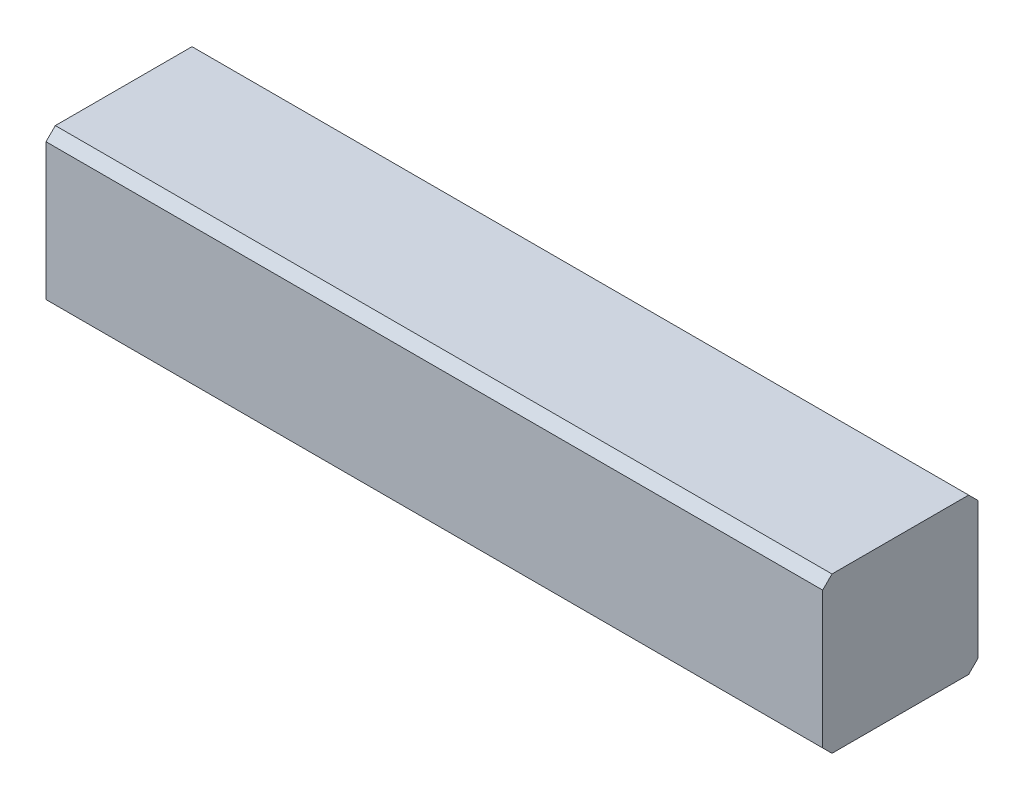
from build123d import *

# Parameters (mm, degrees)
SKETCH1_W           = 25
SKETCH1_H           = 5
BOSS_EXTRUDE1_DEPTH = 5
SKETCH2_W           = 10
SKETCH2_H           = 10
CUT_EXTRUDE1_DEPTH  = 25


with BuildPart() as part:
    # Sketch1 → Boss-Extrude1 (new body)
    with BuildSketch(Plane.XY):
        with Locations((12.5, 2.5)):
            Rectangle(SKETCH1_W, SKETCH1_H)
    extrude(amount=BOSS_EXTRUDE1_DEPTH)

    # Sketch2 → Cut-Extrude1 (cut)
    with BuildSketch(Plane(origin=(0, 0, 0), x_dir=(0, 0, -1), z_dir=(1, 0, 0))):
        with Locations((-2.5, 2.5)):
            Rectangle(SKETCH2_W, SKETCH2_H)
        Polygon((-5, 0.3), (-4.7, 0), (-0.3, 0), (0, 0.3), (0, 4.7), (-0.3, 5), (-4.7, 5), (-5, 4.7), align=None, mode=Mode.SUBTRACT)
    extrude(amount=CUT_EXTRUDE1_DEPTH, mode=Mode.SUBTRACT)


solid = part.part
